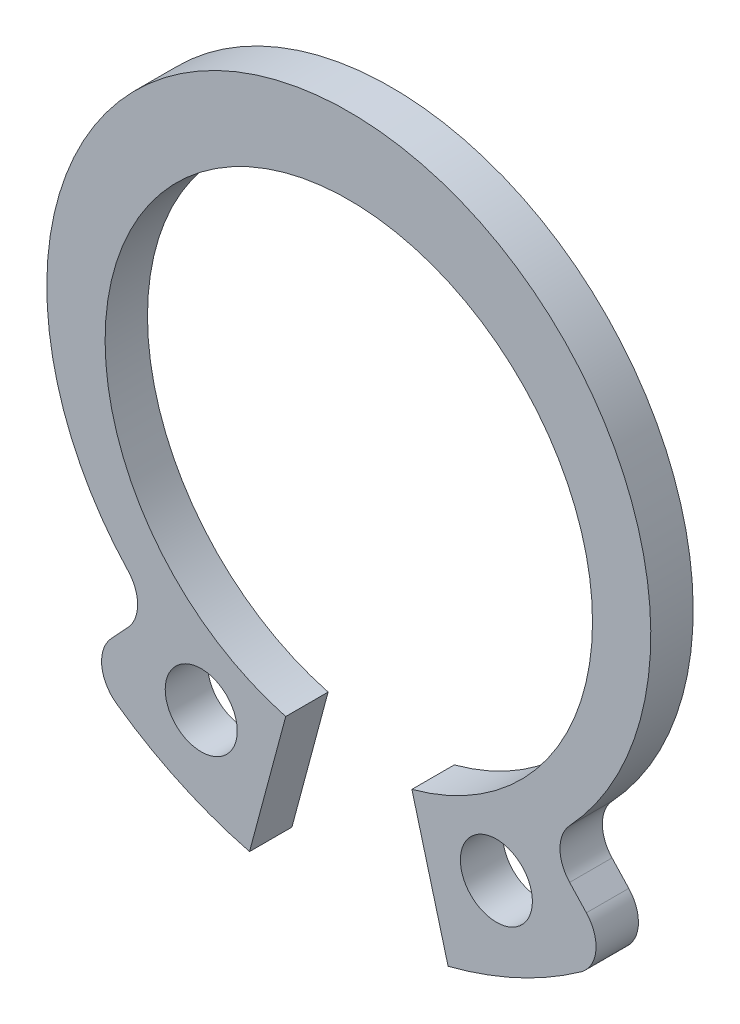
from build123d import *

# Parameters (mm, degrees)
ESQUISSE1_R          = 0.85
BASE_EXTRUSION_DEPTH = 1


with BuildPart() as part:
    # Esquisse1 → Base-Extrusion (new body)
    with BuildSketch(Plane.XY):
        with BuildLine():
            Line((5.209887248, -5.593937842), (5.605262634, -6.018458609))
            ThreePointArc((5.605262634, -6.018458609), (5.828839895, -6.684233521), (5.475141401, -7.290979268))
            ThreePointArc((5.475141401, -7.290979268), (3.975454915, -8.160410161), (2.342312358, -8.741628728))
            Line((2.342312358, -8.741628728), (1.488209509, -5.554073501))
            ThreePointArc((1.488209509, -5.554073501), (0, 5.75), (-1.488209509, -5.554073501))
            Line((-1.488209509, -5.554073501), (-2.342312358, -8.741628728))
            ThreePointArc((-2.342312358, -8.741628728), (-3.975454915, -8.160410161), (-5.475141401, -7.290979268))
            ThreePointArc((-5.475141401, -7.290979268), (-5.828839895, -6.684233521), (-5.605262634, -6.018458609))
            Line((-5.605262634, -6.018458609), (-5.209887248, -5.593937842))
            ThreePointArc((-5.209887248, -5.593937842), (-4.981900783, -5.014312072), (-5.210318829, -4.434856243))
            ThreePointArc((-5.210318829, -4.434856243), (0, 7.55), (5.210318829, -4.434856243))
            ThreePointArc((5.210318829, -4.434856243), (4.981900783, -5.014312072), (5.209887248, -5.593937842))
        make_face()
        with Locations((3.481675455, -6.422526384)):
            Circle(ESQUISSE1_R, mode=Mode.SUBTRACT)
        with Locations(Location((-3.481675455, -6.422526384, 0), (0, 0, 180))):
            Circle(ESQUISSE1_R, mode=Mode.SUBTRACT)
    extrude(amount=BASE_EXTRUSION_DEPTH)


solid = part.part
